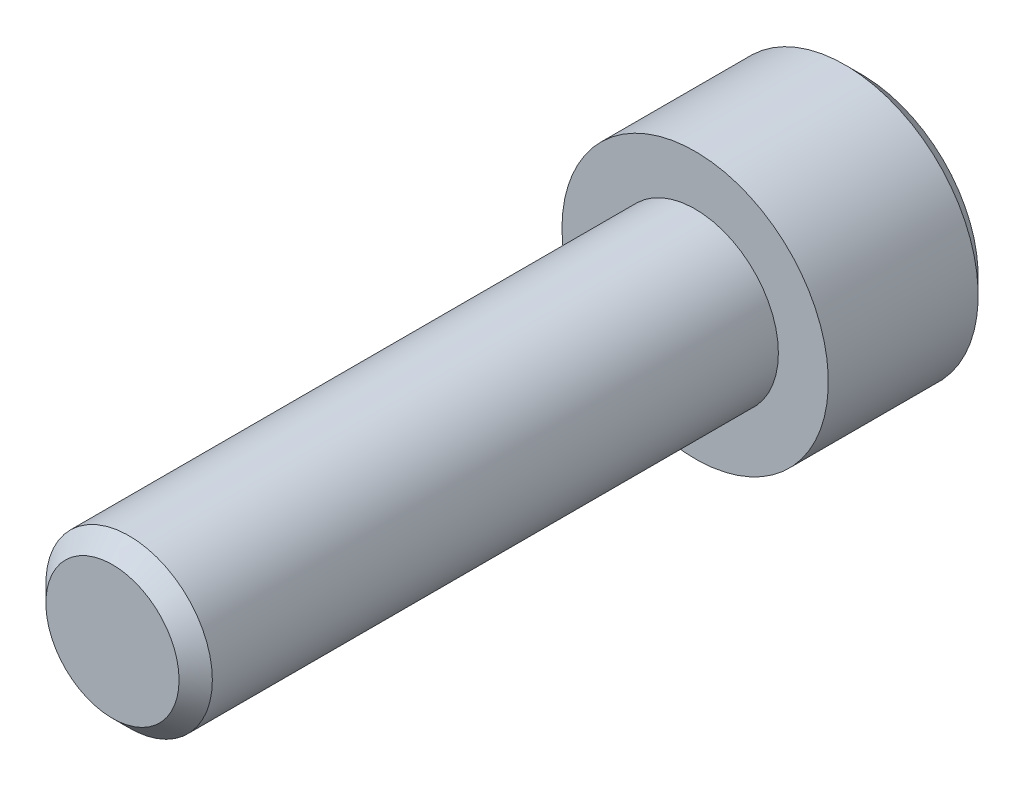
ISO-10303-21;
HEADER;
FILE_DESCRIPTION(('STEP AP214'),'2;1');
FILE_NAME('part.step','',(''),(''),'','','');
FILE_SCHEMA(('AUTOMOTIVE_DESIGN { 1 0 10303 214 1 1 1 1 }'));
ENDSEC;
DATA;
#1=APPLICATION_CONTEXT('core data for automotive mechanical design processes');
#2=APPLICATION_PROTOCOL_DEFINITION('international standard','automotive_design',2000,#1);
#3=PRODUCT_CONTEXT('',#1,'mechanical');
#4=PRODUCT('Part','Part','',(#3));
#5=PRODUCT_RELATED_PRODUCT_CATEGORY('part','',(#4));
#6=PRODUCT_DEFINITION_FORMATION('','',#4);
#7=PRODUCT_DEFINITION_CONTEXT('part definition',#1,'design');
#8=PRODUCT_DEFINITION('design','',#6,#7);
#9=PRODUCT_DEFINITION_SHAPE('','',#8);
#10=(LENGTH_UNIT() NAMED_UNIT(*) SI_UNIT(.MILLI.,.METRE.));
#11=(NAMED_UNIT(*) PLANE_ANGLE_UNIT() SI_UNIT($,.RADIAN.));
#12=(NAMED_UNIT(*) SI_UNIT($,.STERADIAN.) SOLID_ANGLE_UNIT());
#13=UNCERTAINTY_MEASURE_WITH_UNIT(LENGTH_MEASURE(1.E-05),#10,'distance_accuracy_value','');
#14=(GEOMETRIC_REPRESENTATION_CONTEXT(3) GLOBAL_UNCERTAINTY_ASSIGNED_CONTEXT((#13)) GLOBAL_UNIT_ASSIGNED_CONTEXT((#10,
#11,#12)) REPRESENTATION_CONTEXT('',''));
#15=CARTESIAN_POINT('',(0.,0.,0.));
#16=DIRECTION('',(0.,0.,1.));
#17=DIRECTION('',(1.,0.,0.));
#18=AXIS2_PLACEMENT_3D('',#15,#16,#17);
#19=CARTESIAN_POINT('',(-85.,-124.5,-194.));
#20=DIRECTION('',(0.,0.,-1.));
#21=DIRECTION('',(-1.,0.,0.));
#22=AXIS2_PLACEMENT_3D('',#19,#20,#21);
#23=PLANE('',#22);
#24=CARTESIAN_POINT('',(-85.,-124.5,-194.));
#25=DIRECTION('',(0.,0.,-1.));
#26=DIRECTION('',(-1.,0.,0.));
#27=AXIS2_PLACEMENT_3D('',#24,#25,#26);
#28=CIRCLE('',#27,7.);
#29=CARTESIAN_POINT('',(-92.,-124.5,-194.));
#30=VERTEX_POINT('',#29);
#31=EDGE_CURVE('E132',#30,#30,#28,.T.);
#32=ORIENTED_EDGE('',*,*,#31,.T.);
#33=EDGE_LOOP('',(#32));
#34=FACE_BOUND('',#33,.T.);
#35=DIRECTION('',(-0.5,-0.866025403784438,0.));
#36=VECTOR('',#35,1.);
#37=CARTESIAN_POINT('',(-87.3094010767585,-120.5,-194.));
#38=LINE('',#37,#36);
#39=CARTESIAN_POINT('',(-87.3094010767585,-120.5,-194.));
#40=VERTEX_POINT('',#39);
#41=CARTESIAN_POINT('',(-89.618802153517,-124.5,-194.));
#42=VERTEX_POINT('',#41);
#43=EDGE_CURVE('E146',#40,#42,#38,.T.);
#44=ORIENTED_EDGE('',*,*,#43,.T.);
#45=DIRECTION('',(0.5,-0.86602540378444,0.));
#46=VECTOR('',#45,1.);
#47=CARTESIAN_POINT('',(-89.618802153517,-124.5,-194.));
#48=LINE('',#47,#46);
#49=CARTESIAN_POINT('',(-87.3094010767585,-128.5,-194.));
#50=VERTEX_POINT('',#49);
#51=EDGE_CURVE('E83',#42,#50,#48,.T.);
#52=ORIENTED_EDGE('',*,*,#51,.T.);
#53=DIRECTION('',(1.,0.,0.));
#54=VECTOR('',#53,1.);
#55=CARTESIAN_POINT('',(-87.3094010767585,-128.5,-194.));
#56=LINE('',#55,#54);
#57=CARTESIAN_POINT('',(-82.6905989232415,-128.5,-194.));
#58=VERTEX_POINT('',#57);
#59=EDGE_CURVE('E155',#50,#58,#56,.T.);
#60=ORIENTED_EDGE('',*,*,#59,.T.);
#61=DIRECTION('',(0.5,0.866025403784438,0.));
#62=VECTOR('',#61,1.);
#63=CARTESIAN_POINT('',(-82.6905989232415,-128.5,-194.));
#64=LINE('',#63,#62);
#65=CARTESIAN_POINT('',(-80.381197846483,-124.5,-194.));
#66=VERTEX_POINT('',#65);
#67=EDGE_CURVE('E158',#58,#66,#64,.T.);
#68=ORIENTED_EDGE('',*,*,#67,.T.);
#69=DIRECTION('',(-0.5,0.866025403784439,0.));
#70=VECTOR('',#69,1.);
#71=CARTESIAN_POINT('',(-80.381197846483,-124.5,-194.));
#72=LINE('',#71,#70);
#73=CARTESIAN_POINT('',(-82.6905989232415,-120.5,-194.));
#74=VERTEX_POINT('',#73);
#75=EDGE_CURVE('E161',#66,#74,#72,.T.);
#76=ORIENTED_EDGE('',*,*,#75,.T.);
#77=DIRECTION('',(-1.,0.,0.));
#78=VECTOR('',#77,1.);
#79=CARTESIAN_POINT('',(-82.6905989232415,-120.5,-194.));
#80=LINE('',#79,#78);
#81=EDGE_CURVE('E164',#74,#40,#80,.T.);
#82=ORIENTED_EDGE('',*,*,#81,.T.);
#83=EDGE_LOOP('',(#44,#52,#60,#68,#76,#82));
#84=FACE_BOUND('',#83,.T.);
#85=ADVANCED_FACE('F16',(#34,#84),#23,.T.);
#86=CARTESIAN_POINT('',(-85.,-124.5,-184.));
#87=DIRECTION('',(0.,0.,1.));
#88=DIRECTION('',(1.,0.,0.));
#89=AXIS2_PLACEMENT_3D('',#86,#87,#88);
#90=PLANE('',#89);
#91=CARTESIAN_POINT('',(-85.,-124.5,-184.));
#92=DIRECTION('',(0.,0.,1.));
#93=DIRECTION('',(1.,0.,0.));
#94=AXIS2_PLACEMENT_3D('',#91,#92,#93);
#95=CIRCLE('',#94,5.);
#96=CARTESIAN_POINT('',(-80.,-124.5,-184.));
#97=VERTEX_POINT('',#96);
#98=EDGE_CURVE('E120',#97,#97,#95,.T.);
#99=ORIENTED_EDGE('',*,*,#98,.F.);
#100=EDGE_LOOP('',(#99));
#101=FACE_BOUND('',#100,.T.);
#102=CARTESIAN_POINT('',(-85.,-124.5,-184.));
#103=DIRECTION('',(0.,0.,-1.));
#104=DIRECTION('',(-1.,0.,0.));
#105=AXIS2_PLACEMENT_3D('',#102,#103,#104);
#106=CIRCLE('',#105,8.);
#107=CARTESIAN_POINT('',(-93.,-124.5,-184.));
#108=VERTEX_POINT('',#107);
#109=EDGE_CURVE('E138',#108,#108,#106,.T.);
#110=ORIENTED_EDGE('',*,*,#109,.F.);
#111=EDGE_LOOP('',(#110));
#112=FACE_BOUND('',#111,.T.);
#113=ADVANCED_FACE('F194',(#101,#112),#90,.T.);
#114=CARTESIAN_POINT('',(-85.,-124.5,-184.));
#115=DIRECTION('',(0.,0.,-1.));
#116=DIRECTION('',(-1.,0.,0.));
#117=AXIS2_PLACEMENT_3D('',#114,#115,#116);
#118=CYLINDRICAL_SURFACE('',#117,8.);
#119=CARTESIAN_POINT('',(-85.,-124.5,-193.));
#120=DIRECTION('',(0.,0.,-1.));
#121=DIRECTION('',(-1.,0.,0.));
#122=AXIS2_PLACEMENT_3D('',#119,#120,#121);
#123=CIRCLE('',#122,8.);
#124=CARTESIAN_POINT('',(-93.,-124.5,-193.));
#125=VERTEX_POINT('',#124);
#126=EDGE_CURVE('E135',#125,#125,#123,.F.);
#127=ORIENTED_EDGE('',*,*,#126,.T.);
#128=EDGE_LOOP('',(#127));
#129=FACE_BOUND('',#128,.T.);
#130=ORIENTED_EDGE('',*,*,#109,.T.);
#131=EDGE_LOOP('',(#130));
#132=FACE_BOUND('',#131,.T.);
#133=ADVANCED_FACE('F200',(#129,#132),#118,.T.);
#134=CARTESIAN_POINT('',(-85.,-124.5,-193.));
#135=DIRECTION('',(0.,0.,1.));
#136=DIRECTION('',(1.,0.,0.));
#137=AXIS2_PLACEMENT_3D('',#134,#135,#136);
#138=CONICAL_SURFACE('',#137,8.,0.785398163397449);
#139=ORIENTED_EDGE('',*,*,#31,.F.);
#140=EDGE_LOOP('',(#139));
#141=FACE_BOUND('',#140,.T.);
#142=ORIENTED_EDGE('',*,*,#126,.F.);
#143=EDGE_LOOP('',(#142));
#144=FACE_BOUND('',#143,.T.);
#145=ADVANCED_FACE('F207',(#141,#144),#138,.T.);
#146=CARTESIAN_POINT('',(-89.618802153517,-124.5,-188.));
#147=DIRECTION('',(0.86602540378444,0.5,0.));
#148=DIRECTION('',(-0.5,0.86602540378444,0.));
#149=AXIS2_PLACEMENT_3D('',#146,#147,#148);
#150=PLANE('',#149);
#151=DIRECTION('',(0.,0.,-1.));
#152=VECTOR('',#151,1.);
#153=CARTESIAN_POINT('',(-89.618802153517,-124.5,-188.));
#154=LINE('',#153,#152);
#155=CARTESIAN_POINT('',(-89.618802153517,-124.5,-189.455880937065));
#156=VERTEX_POINT('',#155);
#157=EDGE_CURVE('E144',#156,#42,#154,.T.);
#158=ORIENTED_EDGE('',*,*,#157,.F.);
#159=DIRECTION('',(0.5,-0.86602540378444,0.));
#160=VECTOR('',#159,1.);
#161=CARTESIAN_POINT('',(-87.3094010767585,-128.5,-189.455880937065));
#162=LINE('',#161,#160);
#163=CARTESIAN_POINT('',(-87.3094010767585,-128.5,-189.455880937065));
#164=VERTEX_POINT('',#163);
#165=EDGE_CURVE('E112',#156,#164,#162,.T.);
#166=ORIENTED_EDGE('',*,*,#165,.T.);
#167=DIRECTION('',(0.,0.,-1.));
#168=VECTOR('',#167,1.);
#169=CARTESIAN_POINT('',(-87.3094010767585,-128.5,-188.));
#170=LINE('',#169,#168);
#171=EDGE_CURVE('E141',#164,#50,#170,.T.);
#172=ORIENTED_EDGE('',*,*,#171,.T.);
#173=ORIENTED_EDGE('',*,*,#51,.F.);
#174=EDGE_LOOP('',(#158,#166,#172,#173));
#175=FACE_BOUND('',#174,.T.);
#176=ADVANCED_FACE('F174',(#175),#150,.T.);
#177=CARTESIAN_POINT('',(-87.3094010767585,-128.5,-188.));
#178=DIRECTION('',(0.,1.,0.));
#179=DIRECTION('',(-1.,0.,0.));
#180=AXIS2_PLACEMENT_3D('',#177,#178,#179);
#181=PLANE('',#180);
#182=ORIENTED_EDGE('',*,*,#171,.F.);
#183=DIRECTION('',(1.,0.,0.));
#184=VECTOR('',#183,1.);
#185=CARTESIAN_POINT('',(-82.6905989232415,-128.5,-189.455880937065));
#186=LINE('',#185,#184);
#187=CARTESIAN_POINT('',(-82.6905989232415,-128.5,-189.455880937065));
#188=VERTEX_POINT('',#187);
#189=EDGE_CURVE('E115',#164,#188,#186,.T.);
#190=ORIENTED_EDGE('',*,*,#189,.T.);
#191=DIRECTION('',(0.,0.,-1.));
#192=VECTOR('',#191,1.);
#193=CARTESIAN_POINT('',(-82.6905989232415,-128.5,-188.));
#194=LINE('',#193,#192);
#195=EDGE_CURVE('E150',#188,#58,#194,.T.);
#196=ORIENTED_EDGE('',*,*,#195,.T.);
#197=ORIENTED_EDGE('',*,*,#59,.F.);
#198=EDGE_LOOP('',(#182,#190,#196,#197));
#199=FACE_BOUND('',#198,.T.);
#200=ADVANCED_FACE('F178',(#199),#181,.T.);
#201=CARTESIAN_POINT('',(-82.6905989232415,-128.5,-188.));
#202=DIRECTION('',(-0.866025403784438,0.5,0.));
#203=DIRECTION('',(-0.5,-0.866025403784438,0.));
#204=AXIS2_PLACEMENT_3D('',#201,#202,#203);
#205=PLANE('',#204);
#206=ORIENTED_EDGE('',*,*,#195,.F.);
#207=DIRECTION('',(0.5,0.866025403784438,0.));
#208=VECTOR('',#207,1.);
#209=CARTESIAN_POINT('',(-80.381197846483,-124.5,-189.455880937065));
#210=LINE('',#209,#208);
#211=CARTESIAN_POINT('',(-80.381197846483,-124.5,-189.455880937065));
#212=VERTEX_POINT('',#211);
#213=EDGE_CURVE('E103',#188,#212,#210,.T.);
#214=ORIENTED_EDGE('',*,*,#213,.T.);
#215=DIRECTION('',(0.,0.,-1.));
#216=VECTOR('',#215,1.);
#217=CARTESIAN_POINT('',(-80.381197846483,-124.5,-188.));
#218=LINE('',#217,#216);
#219=EDGE_CURVE('E148',#212,#66,#218,.T.);
#220=ORIENTED_EDGE('',*,*,#219,.T.);
#221=ORIENTED_EDGE('',*,*,#67,.F.);
#222=EDGE_LOOP('',(#206,#214,#220,#221));
#223=FACE_BOUND('',#222,.T.);
#224=ADVANCED_FACE('F181',(#223),#205,.T.);
#225=CARTESIAN_POINT('',(-80.381197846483,-124.5,-188.));
#226=DIRECTION('',(-0.866025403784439,-0.5,0.));
#227=DIRECTION('',(0.5,-0.866025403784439,0.));
#228=AXIS2_PLACEMENT_3D('',#225,#226,#227);
#229=PLANE('',#228);
#230=ORIENTED_EDGE('',*,*,#219,.F.);
#231=DIRECTION('',(-0.5,0.866025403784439,0.));
#232=VECTOR('',#231,1.);
#233=CARTESIAN_POINT('',(-82.6905989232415,-120.5,-189.455880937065));
#234=LINE('',#233,#232);
#235=CARTESIAN_POINT('',(-82.6905989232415,-120.5,-189.455880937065));
#236=VERTEX_POINT('',#235);
#237=EDGE_CURVE('E32',#212,#236,#234,.T.);
#238=ORIENTED_EDGE('',*,*,#237,.T.);
#239=DIRECTION('',(0.,0.,-1.));
#240=VECTOR('',#239,1.);
#241=CARTESIAN_POINT('',(-82.6905989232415,-120.5,-188.));
#242=LINE('',#241,#240);
#243=EDGE_CURVE('E143',#236,#74,#242,.T.);
#244=ORIENTED_EDGE('',*,*,#243,.T.);
#245=ORIENTED_EDGE('',*,*,#75,.F.);
#246=EDGE_LOOP('',(#230,#238,#244,#245));
#247=FACE_BOUND('',#246,.T.);
#248=ADVANCED_FACE('F182',(#247),#229,.T.);
#249=CARTESIAN_POINT('',(-82.6905989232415,-120.5,-188.));
#250=DIRECTION('',(0.,-1.,0.));
#251=DIRECTION('',(1.,0.,0.));
#252=AXIS2_PLACEMENT_3D('',#249,#250,#251);
#253=PLANE('',#252);
#254=ORIENTED_EDGE('',*,*,#243,.F.);
#255=DIRECTION('',(-1.,0.,0.));
#256=VECTOR('',#255,1.);
#257=CARTESIAN_POINT('',(-87.3094010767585,-120.5,-189.455880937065));
#258=LINE('',#257,#256);
#259=CARTESIAN_POINT('',(-87.3094010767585,-120.5,-189.455880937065));
#260=VERTEX_POINT('',#259);
#261=EDGE_CURVE('E81',#236,#260,#258,.T.);
#262=ORIENTED_EDGE('',*,*,#261,.T.);
#263=DIRECTION('',(0.,0.,-1.));
#264=VECTOR('',#263,1.);
#265=CARTESIAN_POINT('',(-87.3094010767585,-120.5,-188.));
#266=LINE('',#265,#264);
#267=EDGE_CURVE('E68',#260,#40,#266,.T.);
#268=ORIENTED_EDGE('',*,*,#267,.T.);
#269=ORIENTED_EDGE('',*,*,#81,.F.);
#270=EDGE_LOOP('',(#254,#262,#268,#269));
#271=FACE_BOUND('',#270,.T.);
#272=ADVANCED_FACE('F183',(#271),#253,.T.);
#273=CARTESIAN_POINT('',(-87.3094010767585,-120.5,-188.));
#274=DIRECTION('',(0.866025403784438,-0.5,0.));
#275=DIRECTION('',(0.5,0.866025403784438,0.));
#276=AXIS2_PLACEMENT_3D('',#273,#274,#275);
#277=PLANE('',#276);
#278=ORIENTED_EDGE('',*,*,#267,.F.);
#279=DIRECTION('',(-0.5,-0.866025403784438,0.));
#280=VECTOR('',#279,1.);
#281=CARTESIAN_POINT('',(-89.618802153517,-124.5,-189.455880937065));
#282=LINE('',#281,#280);
#283=EDGE_CURVE('E98',#260,#156,#282,.T.);
#284=ORIENTED_EDGE('',*,*,#283,.T.);
#285=ORIENTED_EDGE('',*,*,#157,.T.);
#286=ORIENTED_EDGE('',*,*,#43,.F.);
#287=EDGE_LOOP('',(#278,#284,#285,#286));
#288=FACE_BOUND('',#287,.T.);
#289=ADVANCED_FACE('F171',(#288),#277,.T.);
#290=CARTESIAN_POINT('',(-80.381197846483,-124.5,-189.455880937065));
#291=DIRECTION('',(-0.296198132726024,-0.171010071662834,-0.939692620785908));
#292=DIRECTION('',(-0.953741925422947,0.,0.300626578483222));
#293=AXIS2_PLACEMENT_3D('',#290,#291,#292);
#294=PLANE('',#293);
#295=DIRECTION('',(-0.476870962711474,-0.825964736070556,0.300626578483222));
#296=VECTOR('',#295,1.);
#297=CARTESIAN_POINT('',(-83.7409418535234,-122.319247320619,-188.793729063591));
#298=LINE('',#297,#296);
#299=CARTESIAN_POINT('',(-85.,-124.5,-188.));
#300=VERTEX_POINT('',#299);
#301=EDGE_CURVE('E75',#236,#300,#298,.T.);
#302=ORIENTED_EDGE('',*,*,#301,.F.);
#303=ORIENTED_EDGE('',*,*,#237,.F.);
#304=DIRECTION('',(0.953741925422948,0.,-0.300626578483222));
#305=VECTOR('',#304,1.);
#306=CARTESIAN_POINT('',(-80.381197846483,-124.5,-189.455880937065));
#307=LINE('',#306,#305);
#308=EDGE_CURVE('E84',#300,#212,#307,.T.);
#309=ORIENTED_EDGE('',*,*,#308,.F.);
#310=EDGE_LOOP('',(#302,#303,#309));
#311=FACE_BOUND('',#310,.T.);
#312=ADVANCED_FACE('F87',(#311),#294,.T.);
#313=CARTESIAN_POINT('',(-82.6905989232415,-120.5,-189.455880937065));
#314=DIRECTION('',(0.,-0.342020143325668,-0.939692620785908));
#315=DIRECTION('',(0.,0.939692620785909,-0.342020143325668));
#316=AXIS2_PLACEMENT_3D('',#313,#314,#315);
#317=PLANE('',#316);
#318=ORIENTED_EDGE('',*,*,#261,.F.);
#319=ORIENTED_EDGE('',*,*,#301,.T.);
#320=DIRECTION('',(-0.476870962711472,0.825964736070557,-0.300626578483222));
#321=VECTOR('',#320,1.);
#322=CARTESIAN_POINT('',(-87.3094010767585,-120.5,-189.455880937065));
#323=LINE('',#322,#321);
#324=EDGE_CURVE('E79',#260,#300,#323,.F.);
#325=ORIENTED_EDGE('',*,*,#324,.F.);
#326=EDGE_LOOP('',(#318,#319,#325));
#327=FACE_BOUND('',#326,.T.);
#328=ADVANCED_FACE('F77',(#327),#317,.T.);
#329=CARTESIAN_POINT('',(-82.6905989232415,-128.5,-189.455880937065));
#330=DIRECTION('',(-0.296198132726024,0.171010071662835,-0.939692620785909));
#331=DIRECTION('',(-0.953741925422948,0.,0.300626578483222));
#332=AXIS2_PLACEMENT_3D('',#329,#330,#331);
#333=PLANE('',#332);
#334=ORIENTED_EDGE('',*,*,#308,.T.);
#335=ORIENTED_EDGE('',*,*,#213,.F.);
#336=DIRECTION('',(-0.476870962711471,0.825964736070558,0.300626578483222));
#337=VECTOR('',#336,1.);
#338=CARTESIAN_POINT('',(-83.7409418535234,-126.680752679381,-188.793729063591));
#339=LINE('',#338,#337);
#340=EDGE_CURVE('E99',#300,#188,#339,.F.);
#341=ORIENTED_EDGE('',*,*,#340,.F.);
#342=EDGE_LOOP('',(#334,#335,#341));
#343=FACE_BOUND('',#342,.T.);
#344=ADVANCED_FACE('F102',(#343),#333,.T.);
#345=CARTESIAN_POINT('',(-87.3094010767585,-120.5,-189.455880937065));
#346=DIRECTION('',(0.296198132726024,-0.171010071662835,-0.939692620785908));
#347=DIRECTION('',(-0.953741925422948,0.,-0.300626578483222));
#348=AXIS2_PLACEMENT_3D('',#345,#346,#347);
#349=PLANE('',#348);
#350=ORIENTED_EDGE('',*,*,#283,.F.);
#351=ORIENTED_EDGE('',*,*,#324,.T.);
#352=DIRECTION('',(-0.953741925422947,0.,-0.300626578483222));
#353=VECTOR('',#352,1.);
#354=CARTESIAN_POINT('',(-89.618802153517,-124.5,-189.455880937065));
#355=LINE('',#354,#353);
#356=EDGE_CURVE('E96',#156,#300,#355,.F.);
#357=ORIENTED_EDGE('',*,*,#356,.F.);
#358=EDGE_LOOP('',(#350,#351,#357));
#359=FACE_BOUND('',#358,.T.);
#360=ADVANCED_FACE('F94',(#359),#349,.T.);
#361=CARTESIAN_POINT('',(-87.3094010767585,-128.5,-189.455880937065));
#362=DIRECTION('',(0.,0.342020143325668,-0.939692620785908));
#363=DIRECTION('',(0.,0.939692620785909,0.342020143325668));
#364=AXIS2_PLACEMENT_3D('',#361,#362,#363);
#365=PLANE('',#364);
#366=ORIENTED_EDGE('',*,*,#340,.T.);
#367=ORIENTED_EDGE('',*,*,#189,.F.);
#368=DIRECTION('',(0.476870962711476,0.825964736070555,0.300626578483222));
#369=VECTOR('',#368,1.);
#370=CARTESIAN_POINT('',(-86.2590581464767,-126.680752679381,-188.793729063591));
#371=LINE('',#370,#369);
#372=EDGE_CURVE('E110',#300,#164,#371,.F.);
#373=ORIENTED_EDGE('',*,*,#372,.F.);
#374=EDGE_LOOP('',(#366,#367,#373));
#375=FACE_BOUND('',#374,.T.);
#376=ADVANCED_FACE('F114',(#375),#365,.T.);
#377=CARTESIAN_POINT('',(-89.618802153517,-124.5,-189.455880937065));
#378=DIRECTION('',(0.296198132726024,0.171010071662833,-0.939692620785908));
#379=DIRECTION('',(-0.953741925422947,0.,-0.300626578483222));
#380=AXIS2_PLACEMENT_3D('',#377,#378,#379);
#381=PLANE('',#380);
#382=ORIENTED_EDGE('',*,*,#165,.F.);
#383=ORIENTED_EDGE('',*,*,#356,.T.);
#384=ORIENTED_EDGE('',*,*,#372,.T.);
#385=EDGE_LOOP('',(#382,#383,#384));
#386=FACE_BOUND('',#385,.T.);
#387=ADVANCED_FACE('F109',(#386),#381,.T.);
#388=CARTESIAN_POINT('',(-85.,-124.5,-124.));
#389=DIRECTION('',(0.,0.,-1.));
#390=DIRECTION('',(-1.,0.,0.));
#391=AXIS2_PLACEMENT_3D('',#388,#389,#390);
#392=CYLINDRICAL_SURFACE('',#391,5.);
#393=CARTESIAN_POINT('',(-85.,-124.5,-150.));
#394=DIRECTION('',(0.,0.,1.));
#395=DIRECTION('',(1.,0.,0.));
#396=AXIS2_PLACEMENT_3D('',#393,#394,#395);
#397=CIRCLE('',#396,5.);
#398=CARTESIAN_POINT('',(-80.,-124.5,-150.));
#399=VERTEX_POINT('',#398);
#400=EDGE_CURVE('E20',#399,#399,#397,.F.);
#401=ORIENTED_EDGE('',*,*,#400,.T.);
#402=EDGE_LOOP('',(#401));
#403=FACE_BOUND('',#402,.T.);
#404=ORIENTED_EDGE('',*,*,#98,.T.);
#405=EDGE_LOOP('',(#404));
#406=FACE_BOUND('',#405,.T.);
#407=ADVANCED_FACE('F214',(#403,#406),#392,.T.);
#408=CARTESIAN_POINT('',(-85.,-124.5,-149.));
#409=DIRECTION('',(0.,0.,1.));
#410=DIRECTION('',(1.,0.,0.));
#411=AXIS2_PLACEMENT_3D('',#408,#409,#410);
#412=PLANE('',#411);
#413=CARTESIAN_POINT('',(-85.,-124.5,-149.));
#414=DIRECTION('',(0.,0.,1.));
#415=DIRECTION('',(1.,0.,0.));
#416=AXIS2_PLACEMENT_3D('',#413,#414,#415);
#417=CIRCLE('',#416,4.);
#418=CARTESIAN_POINT('',(-81.,-124.5,-149.));
#419=VERTEX_POINT('',#418);
#420=EDGE_CURVE('E11',#419,#419,#417,.T.);
#421=ORIENTED_EDGE('',*,*,#420,.T.);
#422=EDGE_LOOP('',(#421));
#423=FACE_BOUND('',#422,.T.);
#424=ADVANCED_FACE('F224',(#423),#412,.T.);
#425=CARTESIAN_POINT('',(-85.,-124.5,-150.));
#426=DIRECTION('',(0.,0.,-1.));
#427=DIRECTION('',(-1.,0.,0.));
#428=AXIS2_PLACEMENT_3D('',#425,#426,#427);
#429=CONICAL_SURFACE('',#428,5.,0.785398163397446);
#430=ORIENTED_EDGE('',*,*,#420,.F.);
#431=EDGE_LOOP('',(#430));
#432=FACE_BOUND('',#431,.T.);
#433=ORIENTED_EDGE('',*,*,#400,.F.);
#434=EDGE_LOOP('',(#433));
#435=FACE_BOUND('',#434,.T.);
#436=ADVANCED_FACE('F18',(#432,#435),#429,.T.);
#437=CLOSED_SHELL('',(#85,#113,#133,#145,#176,#200,#224,#248,#272,#289,#312,#328,#344,#360,#376,
#387,#407,#424,#436));
#438=MANIFOLD_SOLID_BREP('B1',#437);
#439=ADVANCED_BREP_SHAPE_REPRESENTATION('',(#18,#438),#14);
#440=SHAPE_DEFINITION_REPRESENTATION(#9,#439);
ENDSEC;
END-ISO-10303-21;
